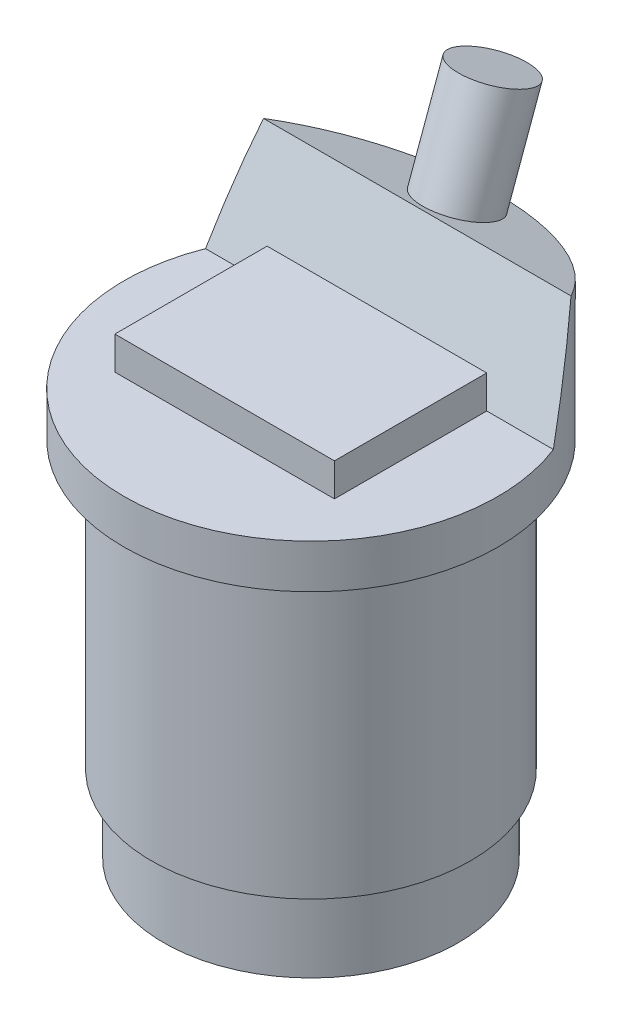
from build123d import *
from build123d.topology import SkipClean

# Parameters (mm, degrees)
SKETCH1_R           = 16.9926
EXTRUDE1_DEPTH      = 3.9878
SKETCH2_R           = 14.4907
EXTRUDE2_DEPTH      = 25.9588
SKETCH3_R           = 13.3985
EXTRUDE3_DEPTH      = 6.985
SKETCH4_W           = 5.957911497
SKETCH4_H           = 34.455391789
EXTRUDE4_DEPTH      = 41.777332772
SKETCH5_W           = 19.9644
SKETCH5_H           = 13.843
EXTRUDE5_DEPTH      = 2.9972
EXTRUDE6_START      = 9.4488
EXTRUDE6_DEPTH      = 9.4488
EXTRUDE7_DEPTH      = 45.061774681
EXTRUDE7_DEPTH_BACK = 45.061774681
SKETCH9_R           = 3.302
EXTRUDE8_DEPTH      = 9.4488


with BuildPart() as part:
    # Sketch1 → Extrude1 (new body)
    with BuildSketch(Plane(origin=(0, 0, 0), x_dir=(1, 0, 0), z_dir=(0, 1, 0))):
        with Locations(Location((0, 0, 0), (0, 0, 270))):
            Circle(SKETCH1_R)
    extrude(amount=-EXTRUDE1_DEPTH)

    # Sketch2 → Extrude2 (add)
    with BuildSketch(Plane.XZ.offset(3.9878)):
        with Locations(Location((0, 0, 0), (0, 0, 90))):
            Circle(SKETCH2_R)
    extrude(amount=EXTRUDE2_DEPTH)

    # Sketch3 → Extrude3 (add)
    with BuildSketch(Plane.XZ.offset(29.9466)):
        with Locations(Location((0, 0, 0), (0, 0, 270))):
            Circle(SKETCH3_R)
    extrude(amount=EXTRUDE3_DEPTH)

    # Sketch4 → Extrude4 (cut, through all)
    with BuildSketch(Plane.XZ.offset(3.9878)):
        with Locations((-16.479055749, -0.340964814)):
            Rectangle(SKETCH4_W, SKETCH4_H)
    extrude(amount=EXTRUDE4_DEPTH, mode=Mode.SUBTRACT)

    # Sketch5 → Extrude5 (add)
    with BuildSketch(Plane(origin=(0, 0, 0), x_dir=(1, 0, 0), z_dir=(0, 1, 0))):
        with Locations((-0.2286, -0.6985)):
            Rectangle(SKETCH5_W, SKETCH5_H)
    extrude(amount=EXTRUDE5_DEPTH)

    # Sketch6 → Extrude6 (add)
    with SkipClean():  # the faces are left unmerged after this step: merging them gives an invalid solid
        with BuildSketch(Plane(origin=(0, 0, 0), x_dir=(1, 0, 0), z_dir=(0, 1, 0)).offset(EXTRUDE6_START)):
            with BuildLine():
                Line((15.812106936, 6.223), (-15.812106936, 6.223))
                ThreePointArc((-15.812106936, 6.223), (0, 16.9926), (15.812106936, 6.223))
            make_face()
        extrude(amount=-EXTRUDE6_DEPTH)

    # Sketch7 → Extrude7 (cut, two sides: drawn at the far end of the back side and taken through both)
    with SkipClean():  # the faces are left unmerged after this step: merging them gives an invalid solid
        with BuildSketch(Plane(origin=(0, 0, 0), x_dir=(0, 0, -1), z_dir=(1, 0, 0)).offset(-EXTRUDE7_DEPTH_BACK)):
            Polygon((6.223, 0), (9.66208195, 9.4488), (19.764284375, 5.771899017), (19.764284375, 15.219863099), (6.223, 15.219863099), align=None)
        extrude(amount=EXTRUDE7_DEPTH + EXTRUDE7_DEPTH_BACK, mode=Mode.SUBTRACT)

    # Sketch9 → Extrude8 (add)
    with SkipClean():  # the faces are left unmerged after this step: merging them gives an invalid solid
        with BuildSketch(Plane(origin=(0, 11.448833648, -4.167034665), x_dir=(1, 0, 0), z_dir=(0, 0.9396926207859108, -0.34202014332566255))):
            with Locations(Location((0, 9.699598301, 0), (0, 0, 90))):
                Circle(SKETCH9_R)
        extrude(amount=EXTRUDE8_DEPTH)


solid = part.part
